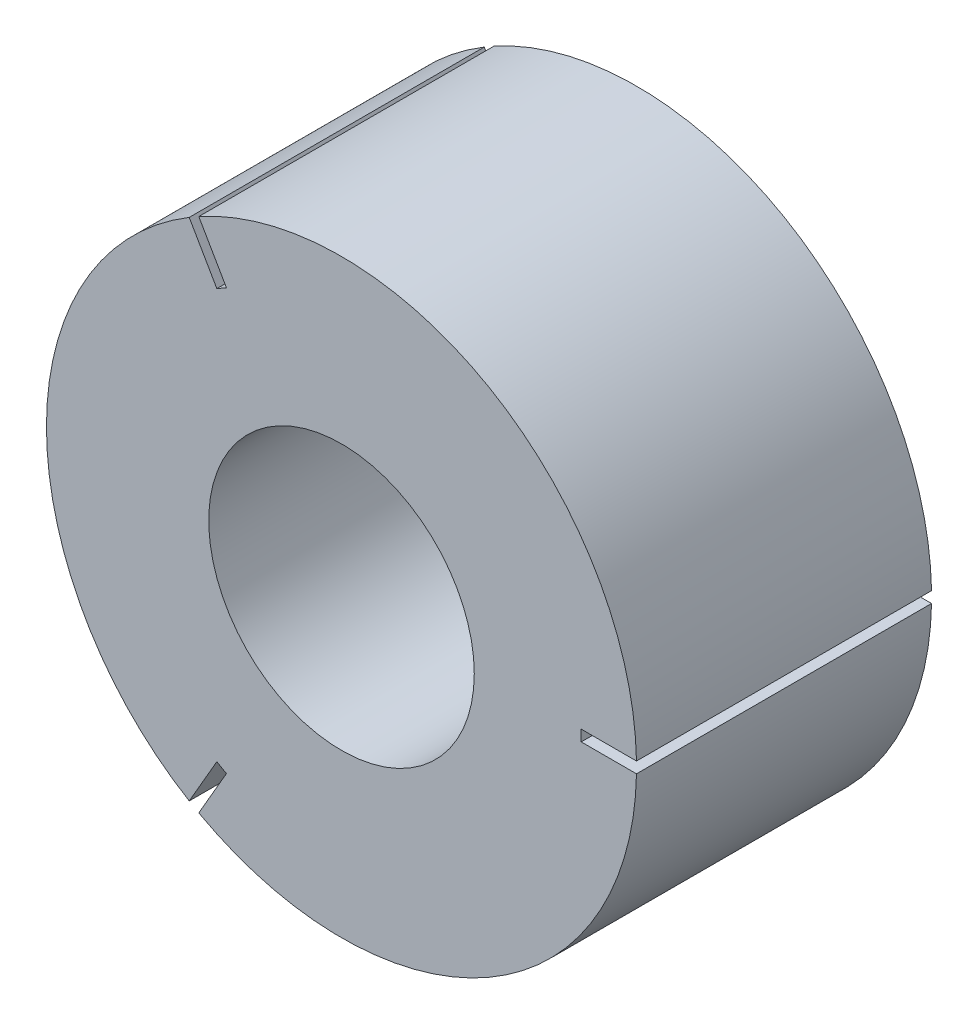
ISO-10303-21;
HEADER;
FILE_DESCRIPTION(('STEP AP214'),'2;1');
FILE_NAME('part.step','',(''),(''),'','','');
FILE_SCHEMA(('AUTOMOTIVE_DESIGN { 1 0 10303 214 1 1 1 1 }'));
ENDSEC;
DATA;
#1=APPLICATION_CONTEXT('core data for automotive mechanical design processes');
#2=APPLICATION_PROTOCOL_DEFINITION('international standard','automotive_design',2000,#1);
#3=PRODUCT_CONTEXT('',#1,'mechanical');
#4=PRODUCT('Part','Part','',(#3));
#5=PRODUCT_RELATED_PRODUCT_CATEGORY('part','',(#4));
#6=PRODUCT_DEFINITION_FORMATION('','',#4);
#7=PRODUCT_DEFINITION_CONTEXT('part definition',#1,'design');
#8=PRODUCT_DEFINITION('design','',#6,#7);
#9=PRODUCT_DEFINITION_SHAPE('','',#8);
#10=(LENGTH_UNIT() NAMED_UNIT(*) SI_UNIT(.MILLI.,.METRE.));
#11=(NAMED_UNIT(*) PLANE_ANGLE_UNIT() SI_UNIT($,.RADIAN.));
#12=(NAMED_UNIT(*) SI_UNIT($,.STERADIAN.) SOLID_ANGLE_UNIT());
#13=UNCERTAINTY_MEASURE_WITH_UNIT(LENGTH_MEASURE(1.E-05),#10,'distance_accuracy_value','');
#14=(GEOMETRIC_REPRESENTATION_CONTEXT(3) GLOBAL_UNCERTAINTY_ASSIGNED_CONTEXT((#13)) GLOBAL_UNIT_ASSIGNED_CONTEXT((#10,
#11,#12)) REPRESENTATION_CONTEXT('',''));
#15=CARTESIAN_POINT('',(0.,0.,0.));
#16=DIRECTION('',(0.,0.,1.));
#17=DIRECTION('',(1.,0.,0.));
#18=AXIS2_PLACEMENT_3D('',#15,#16,#17);
#19=CARTESIAN_POINT('',(0.,0.,40.));
#20=DIRECTION('',(0.,0.,-1.));
#21=DIRECTION('',(-1.,0.,0.));
#22=AXIS2_PLACEMENT_3D('',#19,#20,#21);
#23=CYLINDRICAL_SURFACE('',#22,40.);
#24=CARTESIAN_POINT('',(0.,0.,0.));
#25=DIRECTION('',(0.,0.,1.));
#26=DIRECTION('',(1.,0.,0.));
#27=AXIS2_PLACEMENT_3D('',#24,#25,#26);
#28=CIRCLE('',#27,40.);
#29=CARTESIAN_POINT('',(39.9929681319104,0.75,0.));
#30=VERTEX_POINT('',#29);
#31=CARTESIAN_POINT('',(-19.3469650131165,35.0099263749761,0.));
#32=VERTEX_POINT('',#31);
#33=EDGE_CURVE('E214',#30,#32,#28,.T.);
#34=ORIENTED_EDGE('',*,*,#33,.T.);
#35=DIRECTION('',(0.,0.,-1.));
#36=VECTOR('',#35,1.);
#37=CARTESIAN_POINT('',(-19.3469650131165,35.0099263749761,40.));
#38=LINE('',#37,#36);
#39=CARTESIAN_POINT('',(-19.3469650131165,35.0099263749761,40.));
#40=VERTEX_POINT('',#39);
#41=EDGE_CURVE('E157',#32,#40,#38,.F.);
#42=ORIENTED_EDGE('',*,*,#41,.T.);
#43=CARTESIAN_POINT('',(0.,0.,40.));
#44=DIRECTION('',(0.,0.,1.));
#45=DIRECTION('',(1.,0.,0.));
#46=AXIS2_PLACEMENT_3D('',#43,#44,#45);
#47=CIRCLE('',#46,40.);
#48=CARTESIAN_POINT('',(39.9929681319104,0.75,40.));
#49=VERTEX_POINT('',#48);
#50=EDGE_CURVE('E219',#49,#40,#47,.T.);
#51=ORIENTED_EDGE('',*,*,#50,.F.);
#52=DIRECTION('',(0.,0.,-1.));
#53=VECTOR('',#52,1.);
#54=CARTESIAN_POINT('',(39.9929681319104,0.75,40.));
#55=LINE('',#54,#53);
#56=EDGE_CURVE('E199',#49,#30,#55,.T.);
#57=ORIENTED_EDGE('',*,*,#56,.T.);
#58=EDGE_LOOP('',(#34,#42,#51,#57));
#59=FACE_BOUND('',#58,.T.);
#60=ADVANCED_FACE('F39',(#59),#23,.T.);
#61=CARTESIAN_POINT('',(-20.6460031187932,34.2599263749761,40.));
#62=VERTEX_POINT('',#61);
#63=CARTESIAN_POINT('',(-20.6460031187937,-34.2599263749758,40.));
#64=VERTEX_POINT('',#63);
#65=EDGE_CURVE('E222',#62,#64,#47,.T.);
#66=ORIENTED_EDGE('',*,*,#65,.F.);
#67=DIRECTION('',(0.,0.,-1.));
#68=VECTOR('',#67,1.);
#69=CARTESIAN_POINT('',(-20.6460031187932,34.2599263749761,40.));
#70=LINE('',#69,#68);
#71=CARTESIAN_POINT('',(-20.6460031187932,34.2599263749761,0.));
#72=VERTEX_POINT('',#71);
#73=EDGE_CURVE('E133',#62,#72,#70,.T.);
#74=ORIENTED_EDGE('',*,*,#73,.T.);
#75=CARTESIAN_POINT('',(-20.6460031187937,-34.2599263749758,0.));
#76=VERTEX_POINT('',#75);
#77=EDGE_CURVE('E218',#72,#76,#28,.T.);
#78=ORIENTED_EDGE('',*,*,#77,.T.);
#79=DIRECTION('',(0.,0.,-1.));
#80=VECTOR('',#79,1.);
#81=CARTESIAN_POINT('',(-20.6460031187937,-34.2599263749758,40.));
#82=LINE('',#81,#80);
#83=EDGE_CURVE('E179',#76,#64,#82,.F.);
#84=ORIENTED_EDGE('',*,*,#83,.T.);
#85=EDGE_LOOP('',(#66,#74,#78,#84));
#86=FACE_BOUND('',#85,.T.);
#87=ADVANCED_FACE('F242',(#86),#23,.T.);
#88=CARTESIAN_POINT('',(-19.346965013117,-35.0099263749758,40.));
#89=VERTEX_POINT('',#88);
#90=CARTESIAN_POINT('',(39.9929681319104,-0.75,40.));
#91=VERTEX_POINT('',#90);
#92=EDGE_CURVE('E217',#89,#91,#47,.T.);
#93=ORIENTED_EDGE('',*,*,#92,.F.);
#94=DIRECTION('',(0.,0.,-1.));
#95=VECTOR('',#94,1.);
#96=CARTESIAN_POINT('',(-19.346965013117,-35.0099263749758,40.));
#97=LINE('',#96,#95);
#98=CARTESIAN_POINT('',(-19.346965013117,-35.0099263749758,0.));
#99=VERTEX_POINT('',#98);
#100=EDGE_CURVE('E175',#89,#99,#97,.T.);
#101=ORIENTED_EDGE('',*,*,#100,.T.);
#102=CARTESIAN_POINT('',(39.9929681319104,-0.75,0.));
#103=VERTEX_POINT('',#102);
#104=EDGE_CURVE('E213',#99,#103,#28,.T.);
#105=ORIENTED_EDGE('',*,*,#104,.T.);
#106=DIRECTION('',(0.,0.,-1.));
#107=VECTOR('',#106,1.);
#108=CARTESIAN_POINT('',(39.9929681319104,-0.75,40.));
#109=LINE('',#108,#107);
#110=EDGE_CURVE('E204',#103,#91,#109,.F.);
#111=ORIENTED_EDGE('',*,*,#110,.T.);
#112=EDGE_LOOP('',(#93,#101,#105,#111));
#113=FACE_BOUND('',#112,.T.);
#114=ADVANCED_FACE('F41',(#113),#23,.T.);
#115=CARTESIAN_POINT('',(0.,0.,40.));
#116=DIRECTION('',(0.,0.,1.));
#117=DIRECTION('',(1.,0.,0.));
#118=AXIS2_PLACEMENT_3D('',#115,#116,#117);
#119=PLANE('',#118);
#120=DIRECTION('',(-0.499999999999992,0.866025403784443,0.));
#121=VECTOR('',#120,1.);
#122=CARTESIAN_POINT('',(-19.3504809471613,35.0160161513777,40.));
#123=LINE('',#122,#121);
#124=CARTESIAN_POINT('',(-15.6004809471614,28.5208256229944,40.));
#125=VERTEX_POINT('',#124);
#126=EDGE_CURVE('E148',#125,#40,#123,.T.);
#127=ORIENTED_EDGE('',*,*,#126,.F.);
#128=DIRECTION('',(0.866025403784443,0.499999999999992,0.));
#129=VECTOR('',#128,1.);
#130=CARTESIAN_POINT('',(-16.8995190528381,27.7708256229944,40.));
#131=LINE('',#130,#129);
#132=CARTESIAN_POINT('',(-16.8995190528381,27.7708256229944,40.));
#133=VERTEX_POINT('',#132);
#134=EDGE_CURVE('E137',#133,#125,#131,.T.);
#135=ORIENTED_EDGE('',*,*,#134,.F.);
#136=DIRECTION('',(0.499999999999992,-0.866025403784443,0.));
#137=VECTOR('',#136,1.);
#138=CARTESIAN_POINT('',(-20.649519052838,34.2660161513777,40.));
#139=LINE('',#138,#137);
#140=EDGE_CURVE('E129',#62,#133,#139,.T.);
#141=ORIENTED_EDGE('',*,*,#140,.F.);
#142=ORIENTED_EDGE('',*,*,#65,.T.);
#143=DIRECTION('',(-0.500000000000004,-0.866025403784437,0.));
#144=VECTOR('',#143,1.);
#145=CARTESIAN_POINT('',(-20.6495190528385,-34.2660161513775,40.));
#146=LINE('',#145,#144);
#147=CARTESIAN_POINT('',(-16.8995190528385,-27.7708256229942,40.));
#148=VERTEX_POINT('',#147);
#149=EDGE_CURVE('E165',#148,#64,#146,.T.);
#150=ORIENTED_EDGE('',*,*,#149,.F.);
#151=DIRECTION('',(-0.866025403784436,0.500000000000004,0.));
#152=VECTOR('',#151,1.);
#153=CARTESIAN_POINT('',(-15.6004809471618,-28.5208256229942,40.));
#154=LINE('',#153,#152);
#155=CARTESIAN_POINT('',(-15.6004809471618,-28.5208256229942,40.));
#156=VERTEX_POINT('',#155);
#157=EDGE_CURVE('E162',#156,#148,#154,.T.);
#158=ORIENTED_EDGE('',*,*,#157,.F.);
#159=DIRECTION('',(0.500000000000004,0.866025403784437,0.));
#160=VECTOR('',#159,1.);
#161=CARTESIAN_POINT('',(-19.3504809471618,-35.0160161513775,40.));
#162=LINE('',#161,#160);
#163=EDGE_CURVE('E160',#89,#156,#162,.T.);
#164=ORIENTED_EDGE('',*,*,#163,.F.);
#165=ORIENTED_EDGE('',*,*,#92,.T.);
#166=DIRECTION('',(1.,0.,0.));
#167=VECTOR('',#166,1.);
#168=CARTESIAN_POINT('',(40.,-0.75,40.));
#169=LINE('',#168,#167);
#170=CARTESIAN_POINT('',(32.5,-0.750000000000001,40.));
#171=VERTEX_POINT('',#170);
#172=EDGE_CURVE('E187',#171,#91,#169,.T.);
#173=ORIENTED_EDGE('',*,*,#172,.F.);
#174=DIRECTION('',(0.,-1.,0.));
#175=VECTOR('',#174,1.);
#176=CARTESIAN_POINT('',(32.5,0.749999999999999,40.));
#177=LINE('',#176,#175);
#178=CARTESIAN_POINT('',(32.5,0.749999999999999,40.));
#179=VERTEX_POINT('',#178);
#180=EDGE_CURVE('E184',#179,#171,#177,.T.);
#181=ORIENTED_EDGE('',*,*,#180,.F.);
#182=DIRECTION('',(-1.,0.,0.));
#183=VECTOR('',#182,1.);
#184=CARTESIAN_POINT('',(40.,0.75,40.));
#185=LINE('',#184,#183);
#186=EDGE_CURVE('E182',#49,#179,#185,.T.);
#187=ORIENTED_EDGE('',*,*,#186,.F.);
#188=ORIENTED_EDGE('',*,*,#50,.T.);
#189=EDGE_LOOP('',(#127,#135,#141,#142,#150,#158,#164,#165,#173,#181,#187,#188));
#190=FACE_BOUND('',#189,.T.);
#191=CARTESIAN_POINT('',(0.,0.,40.));
#192=DIRECTION('',(0.,0.,1.));
#193=DIRECTION('',(1.,0.,0.));
#194=AXIS2_PLACEMENT_3D('',#191,#192,#193);
#195=CIRCLE('',#194,18.);
#196=CARTESIAN_POINT('',(18.,0.,40.));
#197=VERTEX_POINT('',#196);
#198=EDGE_CURVE('E207',#197,#197,#195,.T.);
#199=ORIENTED_EDGE('',*,*,#198,.F.);
#200=EDGE_LOOP('',(#199));
#201=FACE_BOUND('',#200,.T.);
#202=ADVANCED_FACE('F145',(#190,#201),#119,.T.);
#203=CARTESIAN_POINT('',(0.,0.,0.));
#204=DIRECTION('',(0.,0.,1.));
#205=DIRECTION('',(1.,0.,0.));
#206=AXIS2_PLACEMENT_3D('',#203,#204,#205);
#207=PLANE('',#206);
#208=CARTESIAN_POINT('',(0.,0.,0.));
#209=DIRECTION('',(0.,0.,1.));
#210=DIRECTION('',(1.,0.,0.));
#211=AXIS2_PLACEMENT_3D('',#208,#209,#210);
#212=CIRCLE('',#211,18.);
#213=CARTESIAN_POINT('',(18.,0.,0.));
#214=VERTEX_POINT('',#213);
#215=EDGE_CURVE('E210',#214,#214,#212,.T.);
#216=ORIENTED_EDGE('',*,*,#215,.T.);
#217=EDGE_LOOP('',(#216));
#218=FACE_BOUND('',#217,.T.);
#219=DIRECTION('',(0.866025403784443,0.499999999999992,0.));
#220=VECTOR('',#219,1.);
#221=CARTESIAN_POINT('',(-16.8995190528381,27.7708256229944,0.));
#222=LINE('',#221,#220);
#223=CARTESIAN_POINT('',(-16.8995190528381,27.7708256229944,0.));
#224=VERTEX_POINT('',#223);
#225=CARTESIAN_POINT('',(-15.6004809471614,28.5208256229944,0.));
#226=VERTEX_POINT('',#225);
#227=EDGE_CURVE('E54',#224,#226,#222,.T.);
#228=ORIENTED_EDGE('',*,*,#227,.T.);
#229=DIRECTION('',(-0.499999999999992,0.866025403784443,0.));
#230=VECTOR('',#229,1.);
#231=CARTESIAN_POINT('',(-19.3504809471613,35.0160161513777,0.));
#232=LINE('',#231,#230);
#233=EDGE_CURVE('E143',#226,#32,#232,.T.);
#234=ORIENTED_EDGE('',*,*,#233,.T.);
#235=ORIENTED_EDGE('',*,*,#33,.F.);
#236=DIRECTION('',(-1.,0.,0.));
#237=VECTOR('',#236,1.);
#238=CARTESIAN_POINT('',(0.,0.749999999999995,0.));
#239=LINE('',#238,#237);
#240=CARTESIAN_POINT('',(32.5,0.749999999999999,0.));
#241=VERTEX_POINT('',#240);
#242=EDGE_CURVE('E221',#30,#241,#239,.T.);
#243=ORIENTED_EDGE('',*,*,#242,.T.);
#244=DIRECTION('',(0.,-1.,0.));
#245=VECTOR('',#244,1.);
#246=CARTESIAN_POINT('',(32.5,0.749999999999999,0.));
#247=LINE('',#246,#245);
#248=CARTESIAN_POINT('',(32.5,-0.750000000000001,0.));
#249=VERTEX_POINT('',#248);
#250=EDGE_CURVE('E190',#241,#249,#247,.T.);
#251=ORIENTED_EDGE('',*,*,#250,.T.);
#252=DIRECTION('',(1.,0.,0.));
#253=VECTOR('',#252,1.);
#254=CARTESIAN_POINT('',(40.,-0.75,0.));
#255=LINE('',#254,#253);
#256=EDGE_CURVE('E193',#249,#103,#255,.T.);
#257=ORIENTED_EDGE('',*,*,#256,.T.);
#258=ORIENTED_EDGE('',*,*,#104,.F.);
#259=DIRECTION('',(0.500000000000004,0.866025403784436,0.));
#260=VECTOR('',#259,1.);
#261=CARTESIAN_POINT('',(0.649519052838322,-0.375,0.));
#262=LINE('',#261,#260);
#263=CARTESIAN_POINT('',(-15.6004809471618,-28.5208256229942,0.));
#264=VERTEX_POINT('',#263);
#265=EDGE_CURVE('E47',#99,#264,#262,.T.);
#266=ORIENTED_EDGE('',*,*,#265,.T.);
#267=DIRECTION('',(-0.866025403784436,0.500000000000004,0.));
#268=VECTOR('',#267,1.);
#269=CARTESIAN_POINT('',(-15.6004809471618,-28.5208256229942,0.));
#270=LINE('',#269,#268);
#271=CARTESIAN_POINT('',(-16.8995190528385,-27.7708256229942,0.));
#272=VERTEX_POINT('',#271);
#273=EDGE_CURVE('E62',#264,#272,#270,.T.);
#274=ORIENTED_EDGE('',*,*,#273,.T.);
#275=DIRECTION('',(-0.500000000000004,-0.866025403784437,0.));
#276=VECTOR('',#275,1.);
#277=CARTESIAN_POINT('',(-20.6495190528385,-34.2660161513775,0.));
#278=LINE('',#277,#276);
#279=EDGE_CURVE('E169',#272,#76,#278,.T.);
#280=ORIENTED_EDGE('',*,*,#279,.T.);
#281=ORIENTED_EDGE('',*,*,#77,.F.);
#282=DIRECTION('',(0.499999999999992,-0.866025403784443,0.));
#283=VECTOR('',#282,1.);
#284=CARTESIAN_POINT('',(-0.649519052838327,-0.374999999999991,0.));
#285=LINE('',#284,#283);
#286=EDGE_CURVE('E11',#72,#224,#285,.T.);
#287=ORIENTED_EDGE('',*,*,#286,.T.);
#288=EDGE_LOOP('',(#228,#234,#235,#243,#251,#257,#258,#266,#274,#280,#281,#287));
#289=FACE_BOUND('',#288,.T.);
#290=ADVANCED_FACE('F227',(#218,#289),#207,.F.);
#291=CARTESIAN_POINT('',(0.,0.,0.));
#292=DIRECTION('',(0.,0.,1.));
#293=DIRECTION('',(1.,0.,0.));
#294=AXIS2_PLACEMENT_3D('',#291,#292,#293);
#295=CYLINDRICAL_SURFACE('',#294,18.);
#296=ORIENTED_EDGE('',*,*,#215,.F.);
#297=EDGE_LOOP('',(#296));
#298=FACE_BOUND('',#297,.T.);
#299=ORIENTED_EDGE('',*,*,#198,.T.);
#300=EDGE_LOOP('',(#299));
#301=FACE_BOUND('',#300,.T.);
#302=ADVANCED_FACE('F260',(#298,#301),#295,.F.);
#303=CARTESIAN_POINT('',(40.,-0.75,0.));
#304=DIRECTION('',(0.,-1.,0.));
#305=DIRECTION('',(1.,0.,0.));
#306=AXIS2_PLACEMENT_3D('',#303,#304,#305);
#307=PLANE('',#306);
#308=ORIENTED_EDGE('',*,*,#256,.F.);
#309=DIRECTION('',(0.,0.,1.));
#310=VECTOR('',#309,1.);
#311=CARTESIAN_POINT('',(32.5,-0.750000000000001,0.));
#312=LINE('',#311,#310);
#313=EDGE_CURVE('E197',#249,#171,#312,.T.);
#314=ORIENTED_EDGE('',*,*,#313,.T.);
#315=ORIENTED_EDGE('',*,*,#172,.T.);
#316=ORIENTED_EDGE('',*,*,#110,.F.);
#317=EDGE_LOOP('',(#308,#314,#315,#316));
#318=FACE_BOUND('',#317,.T.);
#319=ADVANCED_FACE('F258',(#318),#307,.F.);
#320=CARTESIAN_POINT('',(40.,0.75,0.));
#321=DIRECTION('',(0.,1.,0.));
#322=DIRECTION('',(-1.,0.,0.));
#323=AXIS2_PLACEMENT_3D('',#320,#321,#322);
#324=PLANE('',#323);
#325=ORIENTED_EDGE('',*,*,#186,.T.);
#326=DIRECTION('',(0.,0.,1.));
#327=VECTOR('',#326,1.);
#328=CARTESIAN_POINT('',(32.5,0.749999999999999,0.));
#329=LINE('',#328,#327);
#330=EDGE_CURVE('E196',#241,#179,#329,.T.);
#331=ORIENTED_EDGE('',*,*,#330,.F.);
#332=ORIENTED_EDGE('',*,*,#242,.F.);
#333=ORIENTED_EDGE('',*,*,#56,.F.);
#334=EDGE_LOOP('',(#325,#331,#332,#333));
#335=FACE_BOUND('',#334,.T.);
#336=ADVANCED_FACE('F251',(#335),#324,.F.);
#337=CARTESIAN_POINT('',(32.5,0.749999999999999,0.));
#338=DIRECTION('',(-1.,0.,0.));
#339=DIRECTION('',(0.,0.,1.));
#340=AXIS2_PLACEMENT_3D('',#337,#338,#339);
#341=PLANE('',#340);
#342=ORIENTED_EDGE('',*,*,#180,.T.);
#343=ORIENTED_EDGE('',*,*,#313,.F.);
#344=ORIENTED_EDGE('',*,*,#250,.F.);
#345=ORIENTED_EDGE('',*,*,#330,.T.);
#346=EDGE_LOOP('',(#342,#343,#344,#345));
#347=FACE_BOUND('',#346,.T.);
#348=ADVANCED_FACE('F255',(#347),#341,.F.);
#349=CARTESIAN_POINT('',(-20.6495190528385,-34.2660161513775,0.));
#350=DIRECTION('',(-0.866025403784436,0.500000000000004,0.));
#351=DIRECTION('',(-0.500000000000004,-0.866025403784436,0.));
#352=AXIS2_PLACEMENT_3D('',#349,#350,#351);
#353=PLANE('',#352);
#354=ORIENTED_EDGE('',*,*,#279,.F.);
#355=DIRECTION('',(0.,0.,1.));
#356=VECTOR('',#355,1.);
#357=CARTESIAN_POINT('',(-16.8995190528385,-27.7708256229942,0.));
#358=LINE('',#357,#356);
#359=EDGE_CURVE('E173',#272,#148,#358,.T.);
#360=ORIENTED_EDGE('',*,*,#359,.T.);
#361=ORIENTED_EDGE('',*,*,#149,.T.);
#362=ORIENTED_EDGE('',*,*,#83,.F.);
#363=EDGE_LOOP('',(#354,#360,#361,#362));
#364=FACE_BOUND('',#363,.T.);
#365=ADVANCED_FACE('F241',(#364),#353,.F.);
#366=CARTESIAN_POINT('',(-19.3504809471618,-35.0160161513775,0.));
#367=DIRECTION('',(0.866025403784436,-0.500000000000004,0.));
#368=DIRECTION('',(0.500000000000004,0.866025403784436,0.));
#369=AXIS2_PLACEMENT_3D('',#366,#367,#368);
#370=PLANE('',#369);
#371=ORIENTED_EDGE('',*,*,#163,.T.);
#372=DIRECTION('',(0.,0.,1.));
#373=VECTOR('',#372,1.);
#374=CARTESIAN_POINT('',(-15.6004809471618,-28.5208256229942,0.));
#375=LINE('',#374,#373);
#376=EDGE_CURVE('E172',#264,#156,#375,.T.);
#377=ORIENTED_EDGE('',*,*,#376,.F.);
#378=ORIENTED_EDGE('',*,*,#265,.F.);
#379=ORIENTED_EDGE('',*,*,#100,.F.);
#380=EDGE_LOOP('',(#371,#377,#378,#379));
#381=FACE_BOUND('',#380,.T.);
#382=ADVANCED_FACE('F229',(#381),#370,.F.);
#383=CARTESIAN_POINT('',(-15.6004809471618,-28.5208256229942,0.));
#384=DIRECTION('',(0.500000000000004,0.866025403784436,0.));
#385=DIRECTION('',(-0.866025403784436,0.500000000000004,0.));
#386=AXIS2_PLACEMENT_3D('',#383,#384,#385);
#387=PLANE('',#386);
#388=ORIENTED_EDGE('',*,*,#157,.T.);
#389=ORIENTED_EDGE('',*,*,#359,.F.);
#390=ORIENTED_EDGE('',*,*,#273,.F.);
#391=ORIENTED_EDGE('',*,*,#376,.T.);
#392=EDGE_LOOP('',(#388,#389,#390,#391));
#393=FACE_BOUND('',#392,.T.);
#394=ADVANCED_FACE('F292',(#393),#387,.F.);
#395=CARTESIAN_POINT('',(-19.3504809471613,35.0160161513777,0.));
#396=DIRECTION('',(0.866025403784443,0.499999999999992,0.));
#397=DIRECTION('',(-0.499999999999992,0.866025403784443,0.));
#398=AXIS2_PLACEMENT_3D('',#395,#396,#397);
#399=PLANE('',#398);
#400=ORIENTED_EDGE('',*,*,#233,.F.);
#401=DIRECTION('',(0.,0.,1.));
#402=VECTOR('',#401,1.);
#403=CARTESIAN_POINT('',(-15.6004809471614,28.5208256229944,0.));
#404=LINE('',#403,#402);
#405=EDGE_CURVE('E142',#226,#125,#404,.T.);
#406=ORIENTED_EDGE('',*,*,#405,.T.);
#407=ORIENTED_EDGE('',*,*,#126,.T.);
#408=ORIENTED_EDGE('',*,*,#41,.F.);
#409=EDGE_LOOP('',(#400,#406,#407,#408));
#410=FACE_BOUND('',#409,.T.);
#411=ADVANCED_FACE('F297',(#410),#399,.F.);
#412=CARTESIAN_POINT('',(-20.649519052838,34.2660161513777,0.));
#413=DIRECTION('',(-0.866025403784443,-0.499999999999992,0.));
#414=DIRECTION('',(0.499999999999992,-0.866025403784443,0.));
#415=AXIS2_PLACEMENT_3D('',#412,#413,#414);
#416=PLANE('',#415);
#417=ORIENTED_EDGE('',*,*,#140,.T.);
#418=DIRECTION('',(0.,0.,1.));
#419=VECTOR('',#418,1.);
#420=CARTESIAN_POINT('',(-16.8995190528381,27.7708256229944,0.));
#421=LINE('',#420,#419);
#422=EDGE_CURVE('E131',#224,#133,#421,.T.);
#423=ORIENTED_EDGE('',*,*,#422,.F.);
#424=ORIENTED_EDGE('',*,*,#286,.F.);
#425=ORIENTED_EDGE('',*,*,#73,.F.);
#426=EDGE_LOOP('',(#417,#423,#424,#425));
#427=FACE_BOUND('',#426,.T.);
#428=ADVANCED_FACE('F130',(#427),#416,.F.);
#429=CARTESIAN_POINT('',(-16.8995190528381,27.7708256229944,0.));
#430=DIRECTION('',(0.499999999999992,-0.866025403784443,0.));
#431=DIRECTION('',(0.866025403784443,0.499999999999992,0.));
#432=AXIS2_PLACEMENT_3D('',#429,#430,#431);
#433=PLANE('',#432);
#434=ORIENTED_EDGE('',*,*,#134,.T.);
#435=ORIENTED_EDGE('',*,*,#405,.F.);
#436=ORIENTED_EDGE('',*,*,#227,.F.);
#437=ORIENTED_EDGE('',*,*,#422,.T.);
#438=EDGE_LOOP('',(#434,#435,#436,#437));
#439=FACE_BOUND('',#438,.T.);
#440=ADVANCED_FACE('F140',(#439),#433,.F.);
#441=CLOSED_SHELL('',(#60,#87,#114,#202,#290,#302,#319,#336,#348,#365,#382,#394,#411,#428,#440));
#442=MANIFOLD_SOLID_BREP('B2',#441);
#443=ADVANCED_BREP_SHAPE_REPRESENTATION('',(#18,#442),#14);
#444=SHAPE_DEFINITION_REPRESENTATION(#9,#443);
ENDSEC;
END-ISO-10303-21;
